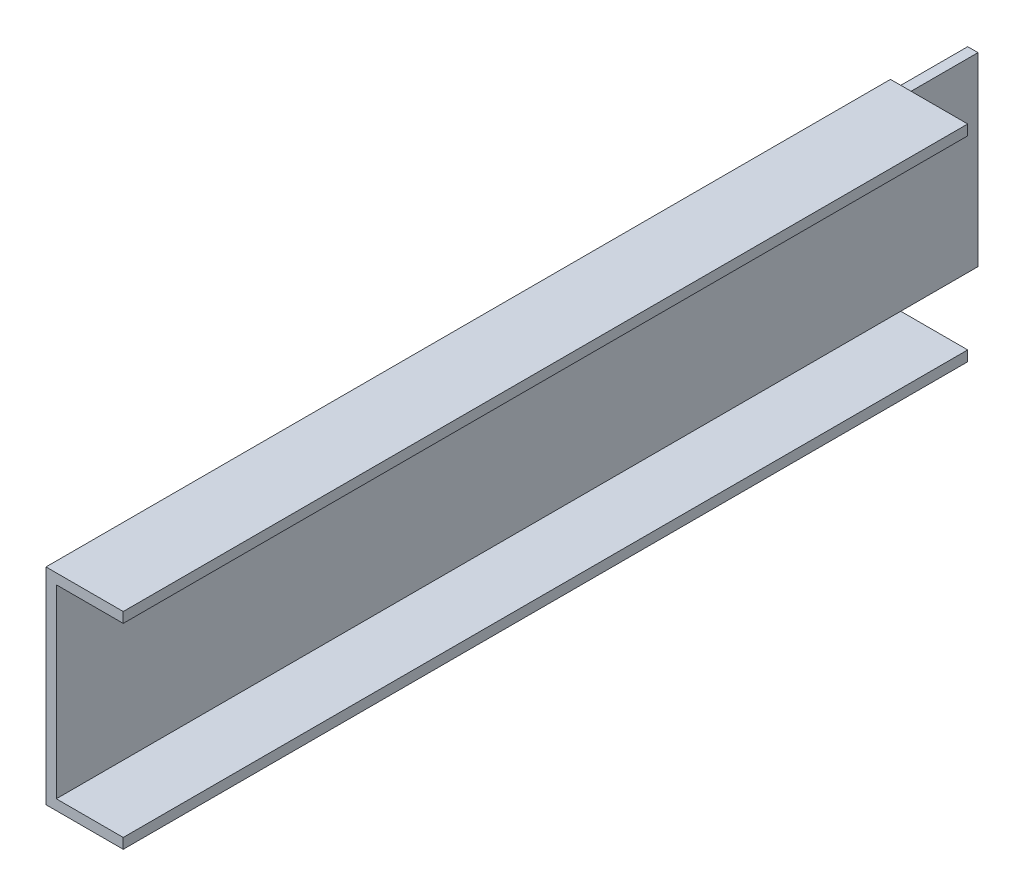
ISO-10303-21;
HEADER;
FILE_DESCRIPTION(('STEP AP214'),'2;1');
FILE_NAME('part.step','',(''),(''),'','','');
FILE_SCHEMA(('AUTOMOTIVE_DESIGN { 1 0 10303 214 1 1 1 1 }'));
ENDSEC;
DATA;
#1=APPLICATION_CONTEXT('core data for automotive mechanical design processes');
#2=APPLICATION_PROTOCOL_DEFINITION('international standard','automotive_design',2000,#1);
#3=PRODUCT_CONTEXT('',#1,'mechanical');
#4=PRODUCT('Part','Part','',(#3));
#5=PRODUCT_RELATED_PRODUCT_CATEGORY('part','',(#4));
#6=PRODUCT_DEFINITION_FORMATION('','',#4);
#7=PRODUCT_DEFINITION_CONTEXT('part definition',#1,'design');
#8=PRODUCT_DEFINITION('design','',#6,#7);
#9=PRODUCT_DEFINITION_SHAPE('','',#8);
#10=(LENGTH_UNIT() NAMED_UNIT(*) SI_UNIT(.MILLI.,.METRE.));
#11=(NAMED_UNIT(*) PLANE_ANGLE_UNIT() SI_UNIT($,.RADIAN.));
#12=(NAMED_UNIT(*) SI_UNIT($,.STERADIAN.) SOLID_ANGLE_UNIT());
#13=UNCERTAINTY_MEASURE_WITH_UNIT(LENGTH_MEASURE(1.E-05),#10,'distance_accuracy_value','');
#14=(GEOMETRIC_REPRESENTATION_CONTEXT(3) GLOBAL_UNCERTAINTY_ASSIGNED_CONTEXT((#13)) GLOBAL_UNIT_ASSIGNED_CONTEXT((#10,
#11,#12)) REPRESENTATION_CONTEXT('',''));
#15=CARTESIAN_POINT('',(0.,0.,0.));
#16=DIRECTION('',(0.,0.,1.));
#17=DIRECTION('',(1.,0.,0.));
#18=AXIS2_PLACEMENT_3D('',#15,#16,#17);
#19=CARTESIAN_POINT('',(75.,10.,447.5));
#20=DIRECTION('',(-1.,0.,0.));
#21=DIRECTION('',(0.,0.,1.));
#22=AXIS2_PLACEMENT_3D('',#19,#20,#21);
#23=PLANE('',#22);
#24=DIRECTION('',(0.,0.,-1.));
#25=VECTOR('',#24,1.);
#26=CARTESIAN_POINT('',(75.,0.,447.5));
#27=LINE('',#26,#25);
#28=CARTESIAN_POINT('',(75.,0.,447.5));
#29=VERTEX_POINT('',#28);
#30=CARTESIAN_POINT('',(75.0000000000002,0.,-372.5));
#31=VERTEX_POINT('',#30);
#32=EDGE_CURVE('E129',#29,#31,#27,.T.);
#33=ORIENTED_EDGE('',*,*,#32,.T.);
#34=DIRECTION('',(0.,-1.,0.));
#35=VECTOR('',#34,1.);
#36=CARTESIAN_POINT('',(75.0000000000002,9.99999999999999,-372.5));
#37=LINE('',#36,#35);
#38=CARTESIAN_POINT('',(75.0000000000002,9.99999999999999,-372.5));
#39=VERTEX_POINT('',#38);
#40=EDGE_CURVE('E180',#39,#31,#37,.T.);
#41=ORIENTED_EDGE('',*,*,#40,.F.);
#42=DIRECTION('',(0.,0.,-1.));
#43=VECTOR('',#42,1.);
#44=CARTESIAN_POINT('',(75.,10.,447.5));
#45=LINE('',#44,#43);
#46=CARTESIAN_POINT('',(75.,10.,447.5));
#47=VERTEX_POINT('',#46);
#48=EDGE_CURVE('E11',#47,#39,#45,.T.);
#49=ORIENTED_EDGE('',*,*,#48,.F.);
#50=DIRECTION('',(0.,1.,0.));
#51=VECTOR('',#50,1.);
#52=CARTESIAN_POINT('',(75.,10.,447.5));
#53=LINE('',#52,#51);
#54=EDGE_CURVE('E139',#29,#47,#53,.T.);
#55=ORIENTED_EDGE('',*,*,#54,.F.);
#56=EDGE_LOOP('',(#33,#41,#49,#55));
#57=FACE_BOUND('',#56,.T.);
#58=ADVANCED_FACE('F35',(#57),#23,.F.);
#59=CARTESIAN_POINT('',(10.,10.,447.5));
#60=DIRECTION('',(0.,-1.,0.));
#61=DIRECTION('',(0.,0.,-1.));
#62=AXIS2_PLACEMENT_3D('',#59,#60,#61);
#63=PLANE('',#62);
#64=ORIENTED_EDGE('',*,*,#48,.T.);
#65=DIRECTION('',(1.,0.,0.));
#66=VECTOR('',#65,1.);
#67=CARTESIAN_POINT('',(-75.6637297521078,9.99999999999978,-372.5));
#68=LINE('',#67,#66);
#69=CARTESIAN_POINT('',(10.,9.9999999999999,-372.5));
#70=VERTEX_POINT('',#69);
#71=EDGE_CURVE('E169',#70,#39,#68,.T.);
#72=ORIENTED_EDGE('',*,*,#71,.F.);
#73=DIRECTION('',(0.,0.,-1.));
#74=VECTOR('',#73,1.);
#75=CARTESIAN_POINT('',(10.,10.,447.5));
#76=LINE('',#75,#74);
#77=CARTESIAN_POINT('',(10.,10.,447.5));
#78=VERTEX_POINT('',#77);
#79=EDGE_CURVE('E42',#78,#70,#76,.T.);
#80=ORIENTED_EDGE('',*,*,#79,.F.);
#81=DIRECTION('',(-1.,0.,0.));
#82=VECTOR('',#81,1.);
#83=CARTESIAN_POINT('',(10.,10.,447.5));
#84=LINE('',#83,#82);
#85=EDGE_CURVE('E167',#47,#78,#84,.T.);
#86=ORIENTED_EDGE('',*,*,#85,.F.);
#87=EDGE_LOOP('',(#64,#72,#80,#86));
#88=FACE_BOUND('',#87,.T.);
#89=ADVANCED_FACE('F166',(#88),#63,.F.);
#90=CARTESIAN_POINT('',(9.99999999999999,190.,447.5));
#91=DIRECTION('',(-1.,0.,0.));
#92=DIRECTION('',(0.,-1.,0.));
#93=AXIS2_PLACEMENT_3D('',#90,#91,#92);
#94=PLANE('',#93);
#95=DIRECTION('',(0.,1.,0.));
#96=VECTOR('',#95,1.);
#97=CARTESIAN_POINT('',(9.99999999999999,190.,-447.5));
#98=LINE('',#97,#96);
#99=CARTESIAN_POINT('',(10.,9.99999999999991,-447.5));
#100=VERTEX_POINT('',#99);
#101=CARTESIAN_POINT('',(9.99999999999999,190.,-447.5));
#102=VERTEX_POINT('',#101);
#103=EDGE_CURVE('E133',#100,#102,#98,.T.);
#104=ORIENTED_EDGE('',*,*,#103,.T.);
#105=DIRECTION('',(0.,0.,1.));
#106=VECTOR('',#105,1.);
#107=CARTESIAN_POINT('',(9.99999999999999,190.,447.5));
#108=LINE('',#107,#106);
#109=CARTESIAN_POINT('',(9.99999999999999,190.,-372.5));
#110=VERTEX_POINT('',#109);
#111=EDGE_CURVE('E71',#102,#110,#108,.T.);
#112=ORIENTED_EDGE('',*,*,#111,.T.);
#113=DIRECTION('',(0.,0.,-1.));
#114=VECTOR('',#113,1.);
#115=CARTESIAN_POINT('',(9.99999999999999,190.,447.5));
#116=LINE('',#115,#114);
#117=CARTESIAN_POINT('',(9.99999999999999,190.,447.5));
#118=VERTEX_POINT('',#117);
#119=EDGE_CURVE('E147',#118,#110,#116,.T.);
#120=ORIENTED_EDGE('',*,*,#119,.F.);
#121=DIRECTION('',(0.,1.,0.));
#122=VECTOR('',#121,1.);
#123=CARTESIAN_POINT('',(9.99999999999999,190.,447.5));
#124=LINE('',#123,#122);
#125=EDGE_CURVE('E161',#78,#118,#124,.T.);
#126=ORIENTED_EDGE('',*,*,#125,.F.);
#127=ORIENTED_EDGE('',*,*,#79,.T.);
#128=DIRECTION('',(0.,0.,-1.));
#129=VECTOR('',#128,1.);
#130=CARTESIAN_POINT('',(10.,9.99999999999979,447.5));
#131=LINE('',#130,#129);
#132=EDGE_CURVE('E158',#70,#100,#131,.T.);
#133=ORIENTED_EDGE('',*,*,#132,.T.);
#134=EDGE_LOOP('',(#104,#112,#120,#126,#127,#133));
#135=FACE_BOUND('',#134,.T.);
#136=ADVANCED_FACE('F155',(#135),#94,.F.);
#137=CARTESIAN_POINT('',(75.,190.,447.5));
#138=DIRECTION('',(0.,1.,0.));
#139=DIRECTION('',(0.,0.,1.));
#140=AXIS2_PLACEMENT_3D('',#137,#138,#139);
#141=PLANE('',#140);
#142=ORIENTED_EDGE('',*,*,#119,.T.);
#143=DIRECTION('',(1.,0.,0.));
#144=VECTOR('',#143,1.);
#145=CARTESIAN_POINT('',(-75.6637297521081,190.,-372.5));
#146=LINE('',#145,#144);
#147=CARTESIAN_POINT('',(75.,190.,-372.5));
#148=VERTEX_POINT('',#147);
#149=EDGE_CURVE('E83',#110,#148,#146,.T.);
#150=ORIENTED_EDGE('',*,*,#149,.T.);
#151=DIRECTION('',(0.,0.,-1.));
#152=VECTOR('',#151,1.);
#153=CARTESIAN_POINT('',(75.,190.,447.5));
#154=LINE('',#153,#152);
#155=CARTESIAN_POINT('',(75.,190.,447.5));
#156=VERTEX_POINT('',#155);
#157=EDGE_CURVE('E144',#156,#148,#154,.T.);
#158=ORIENTED_EDGE('',*,*,#157,.F.);
#159=DIRECTION('',(1.,0.,0.));
#160=VECTOR('',#159,1.);
#161=CARTESIAN_POINT('',(75.,190.,447.5));
#162=LINE('',#161,#160);
#163=EDGE_CURVE('E204',#118,#156,#162,.T.);
#164=ORIENTED_EDGE('',*,*,#163,.F.);
#165=EDGE_LOOP('',(#142,#150,#158,#164));
#166=FACE_BOUND('',#165,.T.);
#167=ADVANCED_FACE('F208',(#166),#141,.F.);
#168=CARTESIAN_POINT('',(75.,200.,447.5));
#169=DIRECTION('',(-1.,0.,0.));
#170=DIRECTION('',(0.,-1.,0.));
#171=AXIS2_PLACEMENT_3D('',#168,#169,#170);
#172=PLANE('',#171);
#173=ORIENTED_EDGE('',*,*,#157,.T.);
#174=DIRECTION('',(0.,-1.,0.));
#175=VECTOR('',#174,1.);
#176=CARTESIAN_POINT('',(75.,200.,-372.5));
#177=LINE('',#176,#175);
#178=CARTESIAN_POINT('',(75.,200.,-372.5));
#179=VERTEX_POINT('',#178);
#180=EDGE_CURVE('E188',#179,#148,#177,.T.);
#181=ORIENTED_EDGE('',*,*,#180,.F.);
#182=DIRECTION('',(0.,0.,-1.));
#183=VECTOR('',#182,1.);
#184=CARTESIAN_POINT('',(75.,200.,447.5));
#185=LINE('',#184,#183);
#186=CARTESIAN_POINT('',(75.,200.,447.5));
#187=VERTEX_POINT('',#186);
#188=EDGE_CURVE('E122',#187,#179,#185,.T.);
#189=ORIENTED_EDGE('',*,*,#188,.F.);
#190=DIRECTION('',(0.,1.,0.));
#191=VECTOR('',#190,1.);
#192=CARTESIAN_POINT('',(75.,200.,447.5));
#193=LINE('',#192,#191);
#194=EDGE_CURVE('E108',#156,#187,#193,.T.);
#195=ORIENTED_EDGE('',*,*,#194,.F.);
#196=EDGE_LOOP('',(#173,#181,#189,#195));
#197=FACE_BOUND('',#196,.T.);
#198=ADVANCED_FACE('F212',(#197),#172,.F.);
#199=CARTESIAN_POINT('',(0.,200.,447.5));
#200=DIRECTION('',(0.,-1.,0.));
#201=DIRECTION('',(0.,0.,-1.));
#202=AXIS2_PLACEMENT_3D('',#199,#200,#201);
#203=PLANE('',#202);
#204=ORIENTED_EDGE('',*,*,#188,.T.);
#205=DIRECTION('',(1.,0.,0.));
#206=VECTOR('',#205,1.);
#207=CARTESIAN_POINT('',(-75.6637297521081,200.,-372.5));
#208=LINE('',#207,#206);
#209=CARTESIAN_POINT('',(0.,200.,-372.5));
#210=VERTEX_POINT('',#209);
#211=EDGE_CURVE('E119',#210,#179,#208,.T.);
#212=ORIENTED_EDGE('',*,*,#211,.F.);
#213=DIRECTION('',(0.,0.,-1.));
#214=VECTOR('',#213,1.);
#215=CARTESIAN_POINT('',(0.,200.,447.5));
#216=LINE('',#215,#214);
#217=CARTESIAN_POINT('',(0.,200.,447.5));
#218=VERTEX_POINT('',#217);
#219=EDGE_CURVE('E115',#218,#210,#216,.T.);
#220=ORIENTED_EDGE('',*,*,#219,.F.);
#221=DIRECTION('',(-1.,0.,0.));
#222=VECTOR('',#221,1.);
#223=CARTESIAN_POINT('',(0.,200.,447.5));
#224=LINE('',#223,#222);
#225=EDGE_CURVE('E101',#187,#218,#224,.T.);
#226=ORIENTED_EDGE('',*,*,#225,.F.);
#227=EDGE_LOOP('',(#204,#212,#220,#226));
#228=FACE_BOUND('',#227,.T.);
#229=ADVANCED_FACE('F116',(#228),#203,.F.);
#230=CARTESIAN_POINT('',(0.,0.,447.5));
#231=DIRECTION('',(1.,0.,0.));
#232=DIRECTION('',(0.,0.,-1.));
#233=AXIS2_PLACEMENT_3D('',#230,#231,#232);
#234=PLANE('',#233);
#235=DIRECTION('',(0.,0.,-1.));
#236=VECTOR('',#235,1.);
#237=CARTESIAN_POINT('',(0.,9.9999999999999,-447.5));
#238=LINE('',#237,#236);
#239=CARTESIAN_POINT('',(0.,9.99999999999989,-372.5));
#240=VERTEX_POINT('',#239);
#241=CARTESIAN_POINT('',(0.,9.9999999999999,-447.5));
#242=VERTEX_POINT('',#241);
#243=EDGE_CURVE('E49',#240,#242,#238,.T.);
#244=ORIENTED_EDGE('',*,*,#243,.F.);
#245=DIRECTION('',(0.,1.,0.));
#246=VECTOR('',#245,1.);
#247=CARTESIAN_POINT('',(0.,9.99999999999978,-372.5));
#248=LINE('',#247,#246);
#249=CARTESIAN_POINT('',(0.,-2.09901540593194E-13,-372.5));
#250=VERTEX_POINT('',#249);
#251=EDGE_CURVE('E186',#250,#240,#248,.T.);
#252=ORIENTED_EDGE('',*,*,#251,.F.);
#253=DIRECTION('',(0.,0.,-1.));
#254=VECTOR('',#253,1.);
#255=CARTESIAN_POINT('',(0.,0.,447.5));
#256=LINE('',#255,#254);
#257=CARTESIAN_POINT('',(0.,0.,447.5));
#258=VERTEX_POINT('',#257);
#259=EDGE_CURVE('E123',#258,#250,#256,.T.);
#260=ORIENTED_EDGE('',*,*,#259,.F.);
#261=DIRECTION('',(0.,-1.,0.));
#262=VECTOR('',#261,1.);
#263=CARTESIAN_POINT('',(0.,0.,447.5));
#264=LINE('',#263,#262);
#265=EDGE_CURVE('E105',#218,#258,#264,.T.);
#266=ORIENTED_EDGE('',*,*,#265,.F.);
#267=ORIENTED_EDGE('',*,*,#219,.T.);
#268=DIRECTION('',(0.,1.,0.));
#269=VECTOR('',#268,1.);
#270=CARTESIAN_POINT('',(0.,200.,-372.5));
#271=LINE('',#270,#269);
#272=CARTESIAN_POINT('',(0.,190.,-372.5));
#273=VERTEX_POINT('',#272);
#274=EDGE_CURVE('E189',#273,#210,#271,.T.);
#275=ORIENTED_EDGE('',*,*,#274,.F.);
#276=DIRECTION('',(0.,0.,1.));
#277=VECTOR('',#276,1.);
#278=CARTESIAN_POINT('',(0.,190.,-447.5));
#279=LINE('',#278,#277);
#280=CARTESIAN_POINT('',(0.,190.,-447.5));
#281=VERTEX_POINT('',#280);
#282=EDGE_CURVE('E192',#281,#273,#279,.T.);
#283=ORIENTED_EDGE('',*,*,#282,.F.);
#284=DIRECTION('',(0.,-1.,0.));
#285=VECTOR('',#284,1.);
#286=CARTESIAN_POINT('',(0.,0.,-447.5));
#287=LINE('',#286,#285);
#288=EDGE_CURVE('E136',#281,#242,#287,.T.);
#289=ORIENTED_EDGE('',*,*,#288,.T.);
#290=EDGE_LOOP('',(#244,#252,#260,#266,#267,#275,#283,#289));
#291=FACE_BOUND('',#290,.T.);
#292=ADVANCED_FACE('F125',(#291),#234,.F.);
#293=CARTESIAN_POINT('',(75.,0.,447.5));
#294=DIRECTION('',(0.,1.,0.));
#295=DIRECTION('',(-1.,0.,0.));
#296=AXIS2_PLACEMENT_3D('',#293,#294,#295);
#297=PLANE('',#296);
#298=ORIENTED_EDGE('',*,*,#259,.T.);
#299=DIRECTION('',(1.,0.,0.));
#300=VECTOR('',#299,1.);
#301=CARTESIAN_POINT('',(-75.6637297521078,-2.10232365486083E-13,-372.5));
#302=LINE('',#301,#300);
#303=EDGE_CURVE('E179',#250,#31,#302,.T.);
#304=ORIENTED_EDGE('',*,*,#303,.T.);
#305=ORIENTED_EDGE('',*,*,#32,.F.);
#306=DIRECTION('',(1.,0.,0.));
#307=VECTOR('',#306,1.);
#308=CARTESIAN_POINT('',(75.,0.,447.5));
#309=LINE('',#308,#307);
#310=EDGE_CURVE('E58',#258,#29,#309,.T.);
#311=ORIENTED_EDGE('',*,*,#310,.F.);
#312=EDGE_LOOP('',(#298,#304,#305,#311));
#313=FACE_BOUND('',#312,.T.);
#314=ADVANCED_FACE('F235',(#313),#297,.F.);
#315=CARTESIAN_POINT('',(0.,0.,447.5));
#316=DIRECTION('',(0.,0.,-1.));
#317=DIRECTION('',(-1.,0.,0.));
#318=AXIS2_PLACEMENT_3D('',#315,#316,#317);
#319=PLANE('',#318);
#320=ORIENTED_EDGE('',*,*,#54,.T.);
#321=ORIENTED_EDGE('',*,*,#85,.T.);
#322=ORIENTED_EDGE('',*,*,#125,.T.);
#323=ORIENTED_EDGE('',*,*,#163,.T.);
#324=ORIENTED_EDGE('',*,*,#194,.T.);
#325=ORIENTED_EDGE('',*,*,#225,.T.);
#326=ORIENTED_EDGE('',*,*,#265,.T.);
#327=ORIENTED_EDGE('',*,*,#310,.T.);
#328=EDGE_LOOP('',(#320,#321,#322,#323,#324,#325,#326,#327));
#329=FACE_BOUND('',#328,.T.);
#330=ADVANCED_FACE('F103',(#329),#319,.F.);
#331=CARTESIAN_POINT('',(0.,0.,-447.5));
#332=DIRECTION('',(0.,0.,-1.));
#333=DIRECTION('',(-1.,0.,0.));
#334=AXIS2_PLACEMENT_3D('',#331,#332,#333);
#335=PLANE('',#334);
#336=DIRECTION('',(1.,0.,0.));
#337=VECTOR('',#336,1.);
#338=CARTESIAN_POINT('',(-75.6637297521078,9.99999999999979,-447.5));
#339=LINE('',#338,#337);
#340=EDGE_CURVE('E177',#242,#100,#339,.T.);
#341=ORIENTED_EDGE('',*,*,#340,.F.);
#342=ORIENTED_EDGE('',*,*,#288,.F.);
#343=DIRECTION('',(1.,0.,0.));
#344=VECTOR('',#343,1.);
#345=CARTESIAN_POINT('',(-75.6637297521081,190.,-447.5));
#346=LINE('',#345,#344);
#347=EDGE_CURVE('E193',#281,#102,#346,.T.);
#348=ORIENTED_EDGE('',*,*,#347,.T.);
#349=ORIENTED_EDGE('',*,*,#103,.F.);
#350=EDGE_LOOP('',(#341,#342,#348,#349));
#351=FACE_BOUND('',#350,.T.);
#352=ADVANCED_FACE('F222',(#351),#335,.T.);
#353=CARTESIAN_POINT('',(-75.6637297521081,190.,-447.5));
#354=DIRECTION('',(0.,-1.,0.));
#355=DIRECTION('',(1.,0.,0.));
#356=AXIS2_PLACEMENT_3D('',#353,#354,#355);
#357=PLANE('',#356);
#358=ORIENTED_EDGE('',*,*,#347,.F.);
#359=ORIENTED_EDGE('',*,*,#282,.T.);
#360=EDGE_CURVE('E197',#273,#110,#146,.T.);
#361=ORIENTED_EDGE('',*,*,#360,.T.);
#362=ORIENTED_EDGE('',*,*,#111,.F.);
#363=EDGE_LOOP('',(#358,#359,#361,#362));
#364=FACE_BOUND('',#363,.T.);
#365=ADVANCED_FACE('F219',(#364),#357,.F.);
#366=CARTESIAN_POINT('',(-75.6637297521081,200.,-372.5));
#367=DIRECTION('',(0.,0.,1.));
#368=DIRECTION('',(1.,0.,0.));
#369=AXIS2_PLACEMENT_3D('',#366,#367,#368);
#370=PLANE('',#369);
#371=ORIENTED_EDGE('',*,*,#274,.T.);
#372=ORIENTED_EDGE('',*,*,#211,.T.);
#373=ORIENTED_EDGE('',*,*,#180,.T.);
#374=ORIENTED_EDGE('',*,*,#149,.F.);
#375=ORIENTED_EDGE('',*,*,#360,.F.);
#376=EDGE_LOOP('',(#371,#372,#373,#374,#375));
#377=FACE_BOUND('',#376,.T.);
#378=ADVANCED_FACE('F261',(#377),#370,.F.);
#379=CARTESIAN_POINT('',(-75.6637297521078,9.99999999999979,-447.5));
#380=DIRECTION('',(0.,1.,0.));
#381=DIRECTION('',(-1.,0.,0.));
#382=AXIS2_PLACEMENT_3D('',#379,#380,#381);
#383=PLANE('',#382);
#384=EDGE_CURVE('E176',#240,#70,#68,.T.);
#385=ORIENTED_EDGE('',*,*,#384,.F.);
#386=ORIENTED_EDGE('',*,*,#243,.T.);
#387=ORIENTED_EDGE('',*,*,#340,.T.);
#388=ORIENTED_EDGE('',*,*,#132,.F.);
#389=EDGE_LOOP('',(#385,#386,#387,#388));
#390=FACE_BOUND('',#389,.T.);
#391=ADVANCED_FACE('F223',(#390),#383,.F.);
#392=CARTESIAN_POINT('',(-75.6637297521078,9.99999999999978,-372.5));
#393=DIRECTION('',(0.,0.,1.));
#394=DIRECTION('',(1.,0.,0.));
#395=AXIS2_PLACEMENT_3D('',#392,#393,#394);
#396=PLANE('',#395);
#397=ORIENTED_EDGE('',*,*,#251,.T.);
#398=ORIENTED_EDGE('',*,*,#384,.T.);
#399=ORIENTED_EDGE('',*,*,#71,.T.);
#400=ORIENTED_EDGE('',*,*,#40,.T.);
#401=ORIENTED_EDGE('',*,*,#303,.F.);
#402=EDGE_LOOP('',(#397,#398,#399,#400,#401));
#403=FACE_BOUND('',#402,.T.);
#404=ADVANCED_FACE('F226',(#403),#396,.F.);
#405=CLOSED_SHELL('',(#58,#89,#136,#167,#198,#229,#292,#314,#330,#352,#365,#378,#391,#404));
#406=MANIFOLD_SOLID_BREP('B2',#405);
#407=ADVANCED_BREP_SHAPE_REPRESENTATION('',(#18,#406),#14);
#408=SHAPE_DEFINITION_REPRESENTATION(#9,#407);
ENDSEC;
END-ISO-10303-21;
